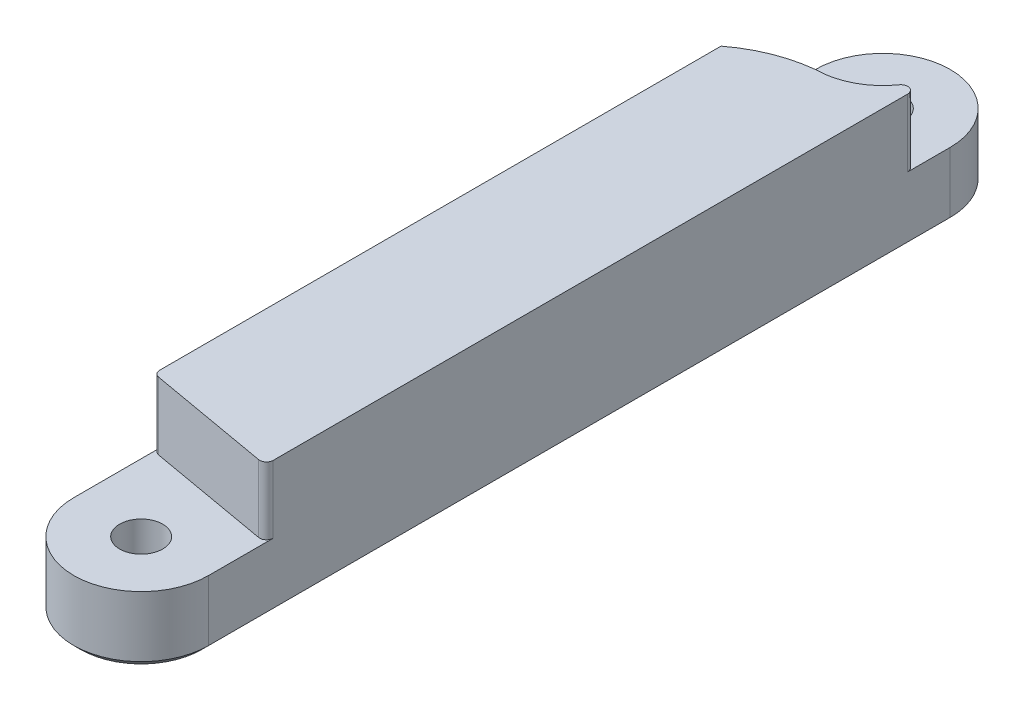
ISO-10303-21;
HEADER;
FILE_DESCRIPTION(('STEP AP214'),'2;1');
FILE_NAME('part.step','',(''),(''),'','','');
FILE_SCHEMA(('AUTOMOTIVE_DESIGN { 1 0 10303 214 1 1 1 1 }'));
ENDSEC;
DATA;
#1=APPLICATION_CONTEXT('core data for automotive mechanical design processes');
#2=APPLICATION_PROTOCOL_DEFINITION('international standard','automotive_design',2000,#1);
#3=PRODUCT_CONTEXT('',#1,'mechanical');
#4=PRODUCT('Part','Part','',(#3));
#5=PRODUCT_RELATED_PRODUCT_CATEGORY('part','',(#4));
#6=PRODUCT_DEFINITION_FORMATION('','',#4);
#7=PRODUCT_DEFINITION_CONTEXT('part definition',#1,'design');
#8=PRODUCT_DEFINITION('design','',#6,#7);
#9=PRODUCT_DEFINITION_SHAPE('','',#8);
#10=(LENGTH_UNIT() NAMED_UNIT(*) SI_UNIT(.MILLI.,.METRE.));
#11=(NAMED_UNIT(*) PLANE_ANGLE_UNIT() SI_UNIT($,.RADIAN.));
#12=(NAMED_UNIT(*) SI_UNIT($,.STERADIAN.) SOLID_ANGLE_UNIT());
#13=UNCERTAINTY_MEASURE_WITH_UNIT(LENGTH_MEASURE(1.E-05),#10,'distance_accuracy_value','');
#14=(GEOMETRIC_REPRESENTATION_CONTEXT(3) GLOBAL_UNCERTAINTY_ASSIGNED_CONTEXT((#13)) GLOBAL_UNIT_ASSIGNED_CONTEXT((#10,
#11,#12)) REPRESENTATION_CONTEXT('',''));
#15=CARTESIAN_POINT('',(0.,0.,0.));
#16=DIRECTION('',(0.,0.,1.));
#17=DIRECTION('',(1.,0.,0.));
#18=AXIS2_PLACEMENT_3D('',#15,#16,#17);
#19=CARTESIAN_POINT('',(0.,5.,0.));
#20=DIRECTION('',(0.,1.,0.));
#21=DIRECTION('',(0.,0.,1.));
#22=AXIS2_PLACEMENT_3D('',#19,#20,#21);
#23=PLANE('',#22);
#24=CARTESIAN_POINT('',(0.,5.,-55.));
#25=DIRECTION('',(0.,1.,0.));
#26=DIRECTION('',(0.,0.,1.));
#27=AXIS2_PLACEMENT_3D('',#24,#25,#26);
#28=CIRCLE('',#27,1.6);
#29=CARTESIAN_POINT('',(0.,5.,-53.4));
#30=VERTEX_POINT('',#29);
#31=EDGE_CURVE('E178',#30,#30,#28,.T.);
#32=ORIENTED_EDGE('',*,*,#31,.F.);
#33=EDGE_LOOP('',(#32));
#34=FACE_BOUND('',#33,.T.);
#35=CARTESIAN_POINT('',(1.07674481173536,5.,-40.0581379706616));
#36=DIRECTION('',(0.,1.,0.));
#37=DIRECTION('',(0.,0.,1.));
#38=AXIS2_PLACEMENT_3D('',#35,#36,#37);
#39=CIRCLE('',#38,9.99999999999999);
#40=CARTESIAN_POINT('',(0.,5.,-50.));
#41=VERTEX_POINT('',#40);
#42=CARTESIAN_POINT('',(-5.,5.,-48.));
#43=VERTEX_POINT('',#42);
#44=EDGE_CURVE('E163',#41,#43,#39,.T.);
#45=ORIENTED_EDGE('',*,*,#44,.F.);
#46=CARTESIAN_POINT('',(0.,5.,-55.));
#47=DIRECTION('',(0.,-1.,0.));
#48=DIRECTION('',(0.,0.,-1.));
#49=AXIS2_PLACEMENT_3D('',#46,#47,#48);
#50=CIRCLE('',#49,5.00000000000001);
#51=CARTESIAN_POINT('',(4.09090909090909,5.,-52.1252021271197));
#52=VERTEX_POINT('',#51);
#53=EDGE_CURVE('E175',#52,#41,#50,.T.);
#54=ORIENTED_EDGE('',*,*,#53,.F.);
#55=CARTESIAN_POINT('',(4.5,5.,-51.8377223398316));
#56=DIRECTION('',(0.,1.,0.));
#57=DIRECTION('',(0.,0.,1.));
#58=AXIS2_PLACEMENT_3D('',#55,#56,#57);
#59=CIRCLE('',#58,0.5);
#60=CARTESIAN_POINT('',(5.,5.,-51.8377223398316));
#61=VERTEX_POINT('',#60);
#62=EDGE_CURVE('E11',#52,#61,#59,.F.);
#63=ORIENTED_EDGE('',*,*,#62,.T.);
#64=DIRECTION('',(0.,0.,1.));
#65=VECTOR('',#64,1.);
#66=CARTESIAN_POINT('',(5.,5.,0.));
#67=LINE('',#66,#65);
#68=CARTESIAN_POINT('',(5.,5.,-55.));
#69=VERTEX_POINT('',#68);
#70=EDGE_CURVE('E66',#69,#61,#67,.T.);
#71=ORIENTED_EDGE('',*,*,#70,.F.);
#72=CARTESIAN_POINT('',(0.,5.,-55.));
#73=DIRECTION('',(0.,1.,0.));
#74=DIRECTION('',(0.,0.,1.));
#75=AXIS2_PLACEMENT_3D('',#72,#73,#74);
#76=CIRCLE('',#75,5.);
#77=CARTESIAN_POINT('',(-5.,5.,-55.));
#78=VERTEX_POINT('',#77);
#79=EDGE_CURVE('E184',#69,#78,#76,.T.);
#80=ORIENTED_EDGE('',*,*,#79,.T.);
#81=DIRECTION('',(0.,0.,-1.));
#82=VECTOR('',#81,1.);
#83=CARTESIAN_POINT('',(-5.,5.,0.));
#84=LINE('',#83,#82);
#85=EDGE_CURVE('E192',#43,#78,#84,.T.);
#86=ORIENTED_EDGE('',*,*,#85,.F.);
#87=EDGE_LOOP('',(#45,#54,#63,#71,#80,#86));
#88=FACE_BOUND('',#87,.T.);
#89=ADVANCED_FACE('F51',(#34,#88),#23,.T.);
#90=CARTESIAN_POINT('',(-5.,10.,0.));
#91=DIRECTION('',(-1.,0.,0.));
#92=DIRECTION('',(0.,0.,1.));
#93=AXIS2_PLACEMENT_3D('',#90,#91,#92);
#94=PLANE('',#93);
#95=DIRECTION('',(0.,-1.,0.));
#96=VECTOR('',#95,1.);
#97=CARTESIAN_POINT('',(-5.,5.,-55.));
#98=LINE('',#97,#96);
#99=CARTESIAN_POINT('',(-5.,0.5,-55.));
#100=VERTEX_POINT('',#99);
#101=EDGE_CURVE('E195',#78,#100,#98,.T.);
#102=ORIENTED_EDGE('',*,*,#101,.T.);
#103=DIRECTION('',(0.,0.,1.));
#104=VECTOR('',#103,1.);
#105=CARTESIAN_POINT('',(-5.,0.5,0.));
#106=LINE('',#105,#104);
#107=CARTESIAN_POINT('',(-5.,0.5,0.));
#108=VERTEX_POINT('',#107);
#109=EDGE_CURVE('E303',#100,#108,#106,.T.);
#110=ORIENTED_EDGE('',*,*,#109,.T.);
#111=DIRECTION('',(0.,-1.,0.));
#112=VECTOR('',#111,1.);
#113=CARTESIAN_POINT('',(-5.,5.,0.));
#114=LINE('',#113,#112);
#115=CARTESIAN_POINT('',(-5.,5.,0.));
#116=VERTEX_POINT('',#115);
#117=EDGE_CURVE('E224',#116,#108,#114,.T.);
#118=ORIENTED_EDGE('',*,*,#117,.F.);
#119=DIRECTION('',(0.,0.,-1.));
#120=VECTOR('',#119,1.);
#121=CARTESIAN_POINT('',(-5.,5.,0.));
#122=LINE('',#121,#120);
#123=CARTESIAN_POINT('',(-5.,5.,-6.37831777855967));
#124=VERTEX_POINT('',#123);
#125=EDGE_CURVE('E207',#116,#124,#122,.T.);
#126=ORIENTED_EDGE('',*,*,#125,.T.);
#127=DIRECTION('',(0.,-1.,0.));
#128=VECTOR('',#127,1.);
#129=CARTESIAN_POINT('',(-5.,10.,-6.37831777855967));
#130=LINE('',#129,#128);
#131=CARTESIAN_POINT('',(-5.,10.,-6.37831777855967));
#132=VERTEX_POINT('',#131);
#133=EDGE_CURVE('E254',#124,#132,#130,.F.);
#134=ORIENTED_EDGE('',*,*,#133,.T.);
#135=DIRECTION('',(0.,0.,-1.));
#136=VECTOR('',#135,1.);
#137=CARTESIAN_POINT('',(-5.,10.,0.));
#138=LINE('',#137,#136);
#139=CARTESIAN_POINT('',(-5.,10.,-48.));
#140=VERTEX_POINT('',#139);
#141=EDGE_CURVE('E228',#132,#140,#138,.T.);
#142=ORIENTED_EDGE('',*,*,#141,.T.);
#143=DIRECTION('',(0.,-1.,0.));
#144=VECTOR('',#143,1.);
#145=CARTESIAN_POINT('',(-5.,10.,-48.));
#146=LINE('',#145,#144);
#147=EDGE_CURVE('E171',#140,#43,#146,.T.);
#148=ORIENTED_EDGE('',*,*,#147,.T.);
#149=ORIENTED_EDGE('',*,*,#85,.T.);
#150=EDGE_LOOP('',(#102,#110,#118,#126,#134,#142,#148,#149));
#151=FACE_BOUND('',#150,.T.);
#152=ADVANCED_FACE('F332',(#151),#94,.T.);
#153=CARTESIAN_POINT('',(0.868240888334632,10.,-4.92403876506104));
#154=DIRECTION('',(-0.173648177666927,0.,0.984807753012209));
#155=DIRECTION('',(0.984807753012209,0.,0.173648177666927));
#156=AXIS2_PLACEMENT_3D('',#153,#154,#155);
#157=PLANE('',#156);
#158=DIRECTION('',(-0.984807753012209,0.,-0.173648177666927));
#159=VECTOR('',#158,1.);
#160=CARTESIAN_POINT('',(0.868240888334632,5.,-4.92403876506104));
#161=LINE('',#160,#159);
#162=CARTESIAN_POINT('',(4.41317591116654,5.,-4.29897107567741));
#163=VERTEX_POINT('',#162);
#164=CARTESIAN_POINT('',(-4.58682408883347,5.,-5.88591390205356));
#165=VERTEX_POINT('',#164);
#166=EDGE_CURVE('E217',#163,#165,#161,.T.);
#167=ORIENTED_EDGE('',*,*,#166,.F.);
#168=DIRECTION('',(0.,-1.,0.));
#169=VECTOR('',#168,1.);
#170=CARTESIAN_POINT('',(4.41317591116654,10.,-4.29897107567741));
#171=LINE('',#170,#169);
#172=CARTESIAN_POINT('',(4.41317591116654,10.,-4.29897107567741));
#173=VERTEX_POINT('',#172);
#174=EDGE_CURVE('E246',#163,#173,#171,.F.);
#175=ORIENTED_EDGE('',*,*,#174,.T.);
#176=DIRECTION('',(-0.984807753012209,0.,-0.173648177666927));
#177=VECTOR('',#176,1.);
#178=CARTESIAN_POINT('',(0.868240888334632,10.,-4.92403876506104));
#179=LINE('',#178,#177);
#180=CARTESIAN_POINT('',(-4.58682408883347,10.,-5.88591390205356));
#181=VERTEX_POINT('',#180);
#182=EDGE_CURVE('E231',#173,#181,#179,.T.);
#183=ORIENTED_EDGE('',*,*,#182,.T.);
#184=DIRECTION('',(0.,-1.,0.));
#185=VECTOR('',#184,1.);
#186=CARTESIAN_POINT('',(-4.58682408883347,10.,-5.88591390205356));
#187=LINE('',#186,#185);
#188=EDGE_CURVE('E242',#181,#165,#187,.T.);
#189=ORIENTED_EDGE('',*,*,#188,.T.);
#190=EDGE_LOOP('',(#167,#175,#183,#189));
#191=FACE_BOUND('',#190,.T.);
#192=ADVANCED_FACE('F341',(#191),#157,.T.);
#193=CARTESIAN_POINT('',(5.,10.,0.));
#194=DIRECTION('',(-1.,0.,0.));
#195=DIRECTION('',(0.,0.,1.));
#196=AXIS2_PLACEMENT_3D('',#193,#194,#195);
#197=PLANE('',#196);
#198=DIRECTION('',(0.,-1.,0.));
#199=VECTOR('',#198,1.);
#200=CARTESIAN_POINT('',(5.,5.,-55.));
#201=LINE('',#200,#199);
#202=CARTESIAN_POINT('',(5.,0.5,-55.));
#203=VERTEX_POINT('',#202);
#204=EDGE_CURVE('E199',#69,#203,#201,.T.);
#205=ORIENTED_EDGE('',*,*,#204,.F.);
#206=ORIENTED_EDGE('',*,*,#70,.T.);
#207=DIRECTION('',(0.,-1.,0.));
#208=VECTOR('',#207,1.);
#209=CARTESIAN_POINT('',(5.,10.,-51.8377223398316));
#210=LINE('',#209,#208);
#211=CARTESIAN_POINT('',(5.,10.,-51.8377223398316));
#212=VERTEX_POINT('',#211);
#213=EDGE_CURVE('E323',#61,#212,#210,.F.);
#214=ORIENTED_EDGE('',*,*,#213,.T.);
#215=DIRECTION('',(0.,0.,-1.));
#216=VECTOR('',#215,1.);
#217=CARTESIAN_POINT('',(5.,10.,0.));
#218=LINE('',#217,#216);
#219=CARTESIAN_POINT('',(5.,10.,-4.79137495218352));
#220=VERTEX_POINT('',#219);
#221=EDGE_CURVE('E235',#220,#212,#218,.T.);
#222=ORIENTED_EDGE('',*,*,#221,.F.);
#223=DIRECTION('',(0.,-1.,0.));
#224=VECTOR('',#223,1.);
#225=CARTESIAN_POINT('',(5.,5.,-4.79137495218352));
#226=LINE('',#225,#224);
#227=CARTESIAN_POINT('',(5.,5.,-4.79137495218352));
#228=VERTEX_POINT('',#227);
#229=EDGE_CURVE('E238',#220,#228,#226,.T.);
#230=ORIENTED_EDGE('',*,*,#229,.T.);
#231=DIRECTION('',(0.,0.,-1.));
#232=VECTOR('',#231,1.);
#233=CARTESIAN_POINT('',(5.,5.,0.));
#234=LINE('',#233,#232);
#235=CARTESIAN_POINT('',(5.,5.,0.));
#236=VERTEX_POINT('',#235);
#237=EDGE_CURVE('E214',#236,#228,#234,.T.);
#238=ORIENTED_EDGE('',*,*,#237,.F.);
#239=DIRECTION('',(0.,-1.,0.));
#240=VECTOR('',#239,1.);
#241=CARTESIAN_POINT('',(5.,5.,0.));
#242=LINE('',#241,#240);
#243=CARTESIAN_POINT('',(5.,0.5,0.));
#244=VERTEX_POINT('',#243);
#245=EDGE_CURVE('E220',#236,#244,#242,.T.);
#246=ORIENTED_EDGE('',*,*,#245,.T.);
#247=DIRECTION('',(0.,0.,-1.));
#248=VECTOR('',#247,1.);
#249=CARTESIAN_POINT('',(5.,0.5,0.));
#250=LINE('',#249,#248);
#251=EDGE_CURVE('E297',#244,#203,#250,.T.);
#252=ORIENTED_EDGE('',*,*,#251,.T.);
#253=EDGE_LOOP('',(#205,#206,#214,#222,#230,#238,#246,#252));
#254=FACE_BOUND('',#253,.T.);
#255=ADVANCED_FACE('F353',(#254),#197,.F.);
#256=CARTESIAN_POINT('',(0.,10.,0.));
#257=DIRECTION('',(0.,1.,0.));
#258=DIRECTION('',(0.,0.,1.));
#259=AXIS2_PLACEMENT_3D('',#256,#257,#258);
#260=PLANE('',#259);
#261=ORIENTED_EDGE('',*,*,#221,.T.);
#262=CARTESIAN_POINT('',(4.5,10.,-51.8377223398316));
#263=DIRECTION('',(0.,1.,0.));
#264=DIRECTION('',(0.,0.,1.));
#265=AXIS2_PLACEMENT_3D('',#262,#263,#264);
#266=CIRCLE('',#265,0.5);
#267=CARTESIAN_POINT('',(4.09090909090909,10.,-52.1252021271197));
#268=VERTEX_POINT('',#267);
#269=EDGE_CURVE('E60',#212,#268,#266,.T.);
#270=ORIENTED_EDGE('',*,*,#269,.T.);
#271=CARTESIAN_POINT('',(0.,10.,-55.));
#272=DIRECTION('',(0.,-1.,0.));
#273=DIRECTION('',(0.,0.,-1.));
#274=AXIS2_PLACEMENT_3D('',#271,#272,#273);
#275=CIRCLE('',#274,5.00000000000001);
#276=CARTESIAN_POINT('',(0.,10.,-50.));
#277=VERTEX_POINT('',#276);
#278=EDGE_CURVE('E150',#268,#277,#275,.T.);
#279=ORIENTED_EDGE('',*,*,#278,.T.);
#280=CARTESIAN_POINT('',(1.07674481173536,10.,-40.0581379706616));
#281=DIRECTION('',(0.,1.,0.));
#282=DIRECTION('',(0.,0.,1.));
#283=AXIS2_PLACEMENT_3D('',#280,#281,#282);
#284=CIRCLE('',#283,9.99999999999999);
#285=EDGE_CURVE('E155',#277,#140,#284,.T.);
#286=ORIENTED_EDGE('',*,*,#285,.T.);
#287=ORIENTED_EDGE('',*,*,#141,.F.);
#288=CARTESIAN_POINT('',(-4.5,10.,-6.37831777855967));
#289=DIRECTION('',(0.,1.,0.));
#290=DIRECTION('',(0.,0.,1.));
#291=AXIS2_PLACEMENT_3D('',#288,#289,#290);
#292=CIRCLE('',#291,0.5);
#293=EDGE_CURVE('E249',#132,#181,#292,.T.);
#294=ORIENTED_EDGE('',*,*,#293,.T.);
#295=ORIENTED_EDGE('',*,*,#182,.F.);
#296=CARTESIAN_POINT('',(4.5,10.,-4.79137495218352));
#297=DIRECTION('',(0.,1.,0.));
#298=DIRECTION('',(0.,0.,1.));
#299=AXIS2_PLACEMENT_3D('',#296,#297,#298);
#300=CIRCLE('',#299,0.5);
#301=EDGE_CURVE('E252',#173,#220,#300,.T.);
#302=ORIENTED_EDGE('',*,*,#301,.T.);
#303=EDGE_LOOP('',(#261,#270,#279,#286,#287,#294,#295,#302));
#304=FACE_BOUND('',#303,.T.);
#305=ADVANCED_FACE('F153',(#304),#260,.T.);
#306=CARTESIAN_POINT('',(0.,0.,0.));
#307=DIRECTION('',(0.,1.,0.));
#308=DIRECTION('',(0.,0.,1.));
#309=AXIS2_PLACEMENT_3D('',#306,#307,#308);
#310=PLANE('',#309);
#311=CARTESIAN_POINT('',(0.,0.,-55.));
#312=DIRECTION('',(0.,1.,0.));
#313=DIRECTION('',(0.,0.,1.));
#314=AXIS2_PLACEMENT_3D('',#311,#312,#313);
#315=CIRCLE('',#314,2.10000000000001);
#316=CARTESIAN_POINT('',(0.,0.,-52.9));
#317=VERTEX_POINT('',#316);
#318=EDGE_CURVE('E281',#317,#317,#315,.T.);
#319=ORIENTED_EDGE('',*,*,#318,.T.);
#320=EDGE_LOOP('',(#319));
#321=FACE_BOUND('',#320,.T.);
#322=CARTESIAN_POINT('',(0.,0.,0.));
#323=DIRECTION('',(0.,1.,0.));
#324=DIRECTION('',(0.,0.,1.));
#325=AXIS2_PLACEMENT_3D('',#322,#323,#324);
#326=CIRCLE('',#325,2.1);
#327=CARTESIAN_POINT('',(0.,0.,2.1));
#328=VERTEX_POINT('',#327);
#329=EDGE_CURVE('E277',#328,#328,#326,.T.);
#330=ORIENTED_EDGE('',*,*,#329,.T.);
#331=EDGE_LOOP('',(#330));
#332=FACE_BOUND('',#331,.T.);
#333=DIRECTION('',(0.,0.,1.));
#334=VECTOR('',#333,1.);
#335=CARTESIAN_POINT('',(4.50000000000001,0.,0.));
#336=LINE('',#335,#334);
#337=CARTESIAN_POINT('',(4.50000000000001,0.,-55.));
#338=VERTEX_POINT('',#337);
#339=CARTESIAN_POINT('',(4.50000000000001,0.,0.));
#340=VERTEX_POINT('',#339);
#341=EDGE_CURVE('E270',#338,#340,#336,.T.);
#342=ORIENTED_EDGE('',*,*,#341,.T.);
#343=CARTESIAN_POINT('',(0.,0.,0.));
#344=DIRECTION('',(0.,1.,0.));
#345=DIRECTION('',(0.,0.,1.));
#346=AXIS2_PLACEMENT_3D('',#343,#344,#345);
#347=CIRCLE('',#346,4.50000000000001);
#348=CARTESIAN_POINT('',(-4.50000000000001,0.,0.));
#349=VERTEX_POINT('',#348);
#350=EDGE_CURVE('E273',#340,#349,#347,.F.);
#351=ORIENTED_EDGE('',*,*,#350,.T.);
#352=DIRECTION('',(0.,0.,-1.));
#353=VECTOR('',#352,1.);
#354=CARTESIAN_POINT('',(-4.50000000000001,0.,-55.));
#355=LINE('',#354,#353);
#356=CARTESIAN_POINT('',(-4.50000000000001,0.,-55.));
#357=VERTEX_POINT('',#356);
#358=EDGE_CURVE('E264',#349,#357,#355,.T.);
#359=ORIENTED_EDGE('',*,*,#358,.T.);
#360=CARTESIAN_POINT('',(0.,0.,-55.));
#361=DIRECTION('',(0.,1.,0.));
#362=DIRECTION('',(0.,0.,1.));
#363=AXIS2_PLACEMENT_3D('',#360,#361,#362);
#364=CIRCLE('',#363,4.50000000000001);
#365=EDGE_CURVE('E267',#357,#338,#364,.F.);
#366=ORIENTED_EDGE('',*,*,#365,.T.);
#367=EDGE_LOOP('',(#342,#351,#359,#366));
#368=FACE_BOUND('',#367,.T.);
#369=ADVANCED_FACE('F381',(#321,#332,#368),#310,.F.);
#370=CARTESIAN_POINT('',(0.,5.,0.));
#371=DIRECTION('',(0.,-1.,0.));
#372=DIRECTION('',(0.,0.,-1.));
#373=AXIS2_PLACEMENT_3D('',#370,#371,#372);
#374=CYLINDRICAL_SURFACE('',#373,5.);
#375=ORIENTED_EDGE('',*,*,#117,.T.);
#376=CARTESIAN_POINT('',(0.,0.5,0.));
#377=DIRECTION('',(0.,1.,0.));
#378=DIRECTION('',(0.,0.,1.));
#379=AXIS2_PLACEMENT_3D('',#376,#377,#378);
#380=CIRCLE('',#379,5.);
#381=EDGE_CURVE('E293',#108,#244,#380,.T.);
#382=ORIENTED_EDGE('',*,*,#381,.T.);
#383=ORIENTED_EDGE('',*,*,#245,.F.);
#384=CARTESIAN_POINT('',(0.,5.,0.));
#385=DIRECTION('',(0.,1.,0.));
#386=DIRECTION('',(0.,0.,1.));
#387=AXIS2_PLACEMENT_3D('',#384,#385,#386);
#388=CIRCLE('',#387,5.);
#389=EDGE_CURVE('E210',#116,#236,#388,.T.);
#390=ORIENTED_EDGE('',*,*,#389,.F.);
#391=EDGE_LOOP('',(#375,#382,#383,#390));
#392=FACE_BOUND('',#391,.T.);
#393=ADVANCED_FACE('F378',(#392),#374,.T.);
#394=CARTESIAN_POINT('',(0.,5.,0.));
#395=DIRECTION('',(0.,-1.,0.));
#396=DIRECTION('',(0.,0.,-1.));
#397=AXIS2_PLACEMENT_3D('',#394,#395,#396);
#398=CYLINDRICAL_SURFACE('',#397,1.6);
#399=CARTESIAN_POINT('',(0.,0.500000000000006,0.));
#400=DIRECTION('',(0.,1.,0.));
#401=DIRECTION('',(0.,0.,1.));
#402=AXIS2_PLACEMENT_3D('',#399,#400,#401);
#403=CIRCLE('',#402,1.6);
#404=CARTESIAN_POINT('',(0.,0.500000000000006,1.6));
#405=VERTEX_POINT('',#404);
#406=EDGE_CURVE('E289',#405,#405,#403,.F.);
#407=ORIENTED_EDGE('',*,*,#406,.T.);
#408=EDGE_LOOP('',(#407));
#409=FACE_BOUND('',#408,.T.);
#410=CARTESIAN_POINT('',(0.,5.,0.));
#411=DIRECTION('',(0.,1.,0.));
#412=DIRECTION('',(0.,0.,1.));
#413=AXIS2_PLACEMENT_3D('',#410,#411,#412);
#414=CIRCLE('',#413,1.6);
#415=CARTESIAN_POINT('',(0.,5.,1.6));
#416=VERTEX_POINT('',#415);
#417=EDGE_CURVE('E203',#416,#416,#414,.T.);
#418=ORIENTED_EDGE('',*,*,#417,.T.);
#419=EDGE_LOOP('',(#418));
#420=FACE_BOUND('',#419,.T.);
#421=ADVANCED_FACE('F376',(#409,#420),#398,.F.);
#422=CARTESIAN_POINT('',(0.,5.,0.));
#423=DIRECTION('',(0.,1.,0.));
#424=DIRECTION('',(0.,0.,1.));
#425=AXIS2_PLACEMENT_3D('',#422,#423,#424);
#426=PLANE('',#425);
#427=ORIENTED_EDGE('',*,*,#417,.F.);
#428=EDGE_LOOP('',(#427));
#429=FACE_BOUND('',#428,.T.);
#430=ORIENTED_EDGE('',*,*,#125,.F.);
#431=ORIENTED_EDGE('',*,*,#389,.T.);
#432=ORIENTED_EDGE('',*,*,#237,.T.);
#433=CARTESIAN_POINT('',(4.5,5.,-4.79137495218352));
#434=DIRECTION('',(0.,1.,0.));
#435=DIRECTION('',(0.,0.,1.));
#436=AXIS2_PLACEMENT_3D('',#433,#434,#435);
#437=CIRCLE('',#436,0.5);
#438=EDGE_CURVE('E257',#228,#163,#437,.F.);
#439=ORIENTED_EDGE('',*,*,#438,.T.);
#440=ORIENTED_EDGE('',*,*,#166,.T.);
#441=CARTESIAN_POINT('',(-4.5,5.,-6.37831777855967));
#442=DIRECTION('',(0.,1.,0.));
#443=DIRECTION('',(0.,0.,1.));
#444=AXIS2_PLACEMENT_3D('',#441,#442,#443);
#445=CIRCLE('',#444,0.5);
#446=EDGE_CURVE('E260',#165,#124,#445,.F.);
#447=ORIENTED_EDGE('',*,*,#446,.T.);
#448=EDGE_LOOP('',(#430,#431,#432,#439,#440,#447));
#449=FACE_BOUND('',#448,.T.);
#450=ADVANCED_FACE('F345',(#429,#449),#426,.T.);
#451=CARTESIAN_POINT('',(0.,5.,-55.));
#452=DIRECTION('',(0.,-1.,0.));
#453=DIRECTION('',(0.,0.,-1.));
#454=AXIS2_PLACEMENT_3D('',#451,#452,#453);
#455=CYLINDRICAL_SURFACE('',#454,5.);
#456=ORIENTED_EDGE('',*,*,#204,.T.);
#457=CARTESIAN_POINT('',(0.,0.5,-55.));
#458=DIRECTION('',(0.,1.,0.));
#459=DIRECTION('',(0.,0.,1.));
#460=AXIS2_PLACEMENT_3D('',#457,#458,#459);
#461=CIRCLE('',#460,5.);
#462=EDGE_CURVE('E300',#203,#100,#461,.T.);
#463=ORIENTED_EDGE('',*,*,#462,.T.);
#464=ORIENTED_EDGE('',*,*,#101,.F.);
#465=ORIENTED_EDGE('',*,*,#79,.F.);
#466=EDGE_LOOP('',(#456,#463,#464,#465));
#467=FACE_BOUND('',#466,.T.);
#468=ADVANCED_FACE('F366',(#467),#455,.T.);
#469=CARTESIAN_POINT('',(0.,5.,-55.));
#470=DIRECTION('',(0.,-1.,0.));
#471=DIRECTION('',(0.,0.,-1.));
#472=AXIS2_PLACEMENT_3D('',#469,#470,#471);
#473=CYLINDRICAL_SURFACE('',#472,1.6);
#474=CARTESIAN_POINT('',(0.,0.500000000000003,-55.));
#475=DIRECTION('',(0.,1.,0.));
#476=DIRECTION('',(0.,0.,1.));
#477=AXIS2_PLACEMENT_3D('',#474,#475,#476);
#478=CIRCLE('',#477,1.6);
#479=CARTESIAN_POINT('',(0.,0.500000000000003,-53.4));
#480=VERTEX_POINT('',#479);
#481=EDGE_CURVE('E285',#480,#480,#478,.F.);
#482=ORIENTED_EDGE('',*,*,#481,.T.);
#483=EDGE_LOOP('',(#482));
#484=FACE_BOUND('',#483,.T.);
#485=ORIENTED_EDGE('',*,*,#31,.T.);
#486=EDGE_LOOP('',(#485));
#487=FACE_BOUND('',#486,.T.);
#488=ADVANCED_FACE('F369',(#484,#487),#473,.F.);
#489=CARTESIAN_POINT('',(0.,10.,-55.));
#490=DIRECTION('',(0.,-1.,0.));
#491=DIRECTION('',(0.,0.,-1.));
#492=AXIS2_PLACEMENT_3D('',#489,#490,#491);
#493=CYLINDRICAL_SURFACE('',#492,5.00000000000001);
#494=ORIENTED_EDGE('',*,*,#278,.F.);
#495=DIRECTION('',(0.,-1.,0.));
#496=VECTOR('',#495,1.);
#497=CARTESIAN_POINT('',(4.09090909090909,10.,-52.1252021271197));
#498=LINE('',#497,#496);
#499=EDGE_CURVE('E306',#268,#52,#498,.T.);
#500=ORIENTED_EDGE('',*,*,#499,.T.);
#501=ORIENTED_EDGE('',*,*,#53,.T.);
#502=DIRECTION('',(0.,-1.,0.));
#503=VECTOR('',#502,1.);
#504=CARTESIAN_POINT('',(0.,10.,-50.));
#505=LINE('',#504,#503);
#506=EDGE_CURVE('E169',#277,#41,#505,.T.);
#507=ORIENTED_EDGE('',*,*,#506,.F.);
#508=EDGE_LOOP('',(#494,#500,#501,#507));
#509=FACE_BOUND('',#508,.T.);
#510=ADVANCED_FACE('F174',(#509),#493,.F.);
#511=CARTESIAN_POINT('',(1.07674481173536,10.,-40.0581379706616));
#512=DIRECTION('',(0.,-1.,0.));
#513=DIRECTION('',(0.,0.,-1.));
#514=AXIS2_PLACEMENT_3D('',#511,#512,#513);
#515=CYLINDRICAL_SURFACE('',#514,9.99999999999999);
#516=ORIENTED_EDGE('',*,*,#44,.T.);
#517=ORIENTED_EDGE('',*,*,#147,.F.);
#518=ORIENTED_EDGE('',*,*,#285,.F.);
#519=ORIENTED_EDGE('',*,*,#506,.T.);
#520=EDGE_LOOP('',(#516,#517,#518,#519));
#521=FACE_BOUND('',#520,.T.);
#522=ADVANCED_FACE('F168',(#521),#515,.T.);
#523=CARTESIAN_POINT('',(4.5,10.,-4.79137495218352));
#524=DIRECTION('',(0.,1.,0.));
#525=DIRECTION('',(0.,0.,1.));
#526=AXIS2_PLACEMENT_3D('',#523,#524,#525);
#527=CYLINDRICAL_SURFACE('',#526,0.5);
#528=ORIENTED_EDGE('',*,*,#301,.F.);
#529=ORIENTED_EDGE('',*,*,#174,.F.);
#530=ORIENTED_EDGE('',*,*,#438,.F.);
#531=ORIENTED_EDGE('',*,*,#229,.F.);
#532=EDGE_LOOP('',(#528,#529,#530,#531));
#533=FACE_BOUND('',#532,.T.);
#534=ADVANCED_FACE('F350',(#533),#527,.T.);
#535=CARTESIAN_POINT('',(-4.5,10.,-6.37831777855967));
#536=DIRECTION('',(0.,-1.,0.));
#537=DIRECTION('',(0.,0.,-1.));
#538=AXIS2_PLACEMENT_3D('',#535,#536,#537);
#539=CYLINDRICAL_SURFACE('',#538,0.5);
#540=ORIENTED_EDGE('',*,*,#293,.F.);
#541=ORIENTED_EDGE('',*,*,#133,.F.);
#542=ORIENTED_EDGE('',*,*,#446,.F.);
#543=ORIENTED_EDGE('',*,*,#188,.F.);
#544=EDGE_LOOP('',(#540,#541,#542,#543));
#545=FACE_BOUND('',#544,.T.);
#546=ADVANCED_FACE('F338',(#545),#539,.T.);
#547=CARTESIAN_POINT('',(0.,0.,-55.));
#548=DIRECTION('',(0.,-1.,0.));
#549=DIRECTION('',(0.,0.,-1.));
#550=AXIS2_PLACEMENT_3D('',#547,#548,#549);
#551=CONICAL_SURFACE('',#550,2.10000000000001,0.785398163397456);
#552=ORIENTED_EDGE('',*,*,#481,.F.);
#553=EDGE_LOOP('',(#552));
#554=FACE_BOUND('',#553,.T.);
#555=ORIENTED_EDGE('',*,*,#318,.F.);
#556=EDGE_LOOP('',(#555));
#557=FACE_BOUND('',#556,.T.);
#558=ADVANCED_FACE('F399',(#554,#557),#551,.F.);
#559=CARTESIAN_POINT('',(0.,0.,0.));
#560=DIRECTION('',(0.,-1.,0.));
#561=DIRECTION('',(0.,0.,-1.));
#562=AXIS2_PLACEMENT_3D('',#559,#560,#561);
#563=CONICAL_SURFACE('',#562,2.1,0.785398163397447);
#564=ORIENTED_EDGE('',*,*,#406,.F.);
#565=EDGE_LOOP('',(#564));
#566=FACE_BOUND('',#565,.T.);
#567=ORIENTED_EDGE('',*,*,#329,.F.);
#568=EDGE_LOOP('',(#567));
#569=FACE_BOUND('',#568,.T.);
#570=ADVANCED_FACE('F406',(#566,#569),#563,.F.);
#571=CARTESIAN_POINT('',(0.,0.5,-55.));
#572=DIRECTION('',(0.,1.,0.));
#573=DIRECTION('',(0.,0.,1.));
#574=AXIS2_PLACEMENT_3D('',#571,#572,#573);
#575=CONICAL_SURFACE('',#574,5.,0.785398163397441);
#576=DIRECTION('',(0.707106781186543,0.707106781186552,0.));
#577=VECTOR('',#576,1.);
#578=CARTESIAN_POINT('',(4.50000000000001,0.,-55.));
#579=LINE('',#578,#577);
#580=EDGE_CURVE('E313',#338,#203,#579,.T.);
#581=ORIENTED_EDGE('',*,*,#580,.F.);
#582=ORIENTED_EDGE('',*,*,#365,.F.);
#583=DIRECTION('',(0.707106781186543,-0.707106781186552,0.));
#584=VECTOR('',#583,1.);
#585=CARTESIAN_POINT('',(-5.,0.5,-55.));
#586=LINE('',#585,#584);
#587=EDGE_CURVE('E317',#100,#357,#586,.T.);
#588=ORIENTED_EDGE('',*,*,#587,.F.);
#589=ORIENTED_EDGE('',*,*,#462,.F.);
#590=EDGE_LOOP('',(#581,#582,#588,#589));
#591=FACE_BOUND('',#590,.T.);
#592=ADVANCED_FACE('F413',(#591),#575,.T.);
#593=CARTESIAN_POINT('',(-4.50000000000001,0.,0.));
#594=DIRECTION('',(-0.707106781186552,-0.707106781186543,0.));
#595=DIRECTION('',(0.,0.,1.));
#596=AXIS2_PLACEMENT_3D('',#593,#594,#595);
#597=PLANE('',#596);
#598=ORIENTED_EDGE('',*,*,#587,.T.);
#599=ORIENTED_EDGE('',*,*,#358,.F.);
#600=DIRECTION('',(0.707106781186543,-0.707106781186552,0.));
#601=VECTOR('',#600,1.);
#602=CARTESIAN_POINT('',(-5.,0.5,0.));
#603=LINE('',#602,#601);
#604=EDGE_CURVE('E310',#108,#349,#603,.T.);
#605=ORIENTED_EDGE('',*,*,#604,.F.);
#606=ORIENTED_EDGE('',*,*,#109,.F.);
#607=EDGE_LOOP('',(#598,#599,#605,#606));
#608=FACE_BOUND('',#607,.T.);
#609=ADVANCED_FACE('F429',(#608),#597,.T.);
#610=CARTESIAN_POINT('',(5.,0.5,0.));
#611=DIRECTION('',(-0.707106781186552,0.707106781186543,0.));
#612=DIRECTION('',(0.,0.,-1.));
#613=AXIS2_PLACEMENT_3D('',#610,#611,#612);
#614=PLANE('',#613);
#615=ORIENTED_EDGE('',*,*,#580,.T.);
#616=ORIENTED_EDGE('',*,*,#251,.F.);
#617=DIRECTION('',(0.707106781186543,0.707106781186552,0.));
#618=VECTOR('',#617,1.);
#619=CARTESIAN_POINT('',(4.50000000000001,0.,0.));
#620=LINE('',#619,#618);
#621=EDGE_CURVE('E307',#340,#244,#620,.T.);
#622=ORIENTED_EDGE('',*,*,#621,.F.);
#623=ORIENTED_EDGE('',*,*,#341,.F.);
#624=EDGE_LOOP('',(#615,#616,#622,#623));
#625=FACE_BOUND('',#624,.T.);
#626=ADVANCED_FACE('F422',(#625),#614,.F.);
#627=CARTESIAN_POINT('',(0.,0.5,0.));
#628=DIRECTION('',(0.,1.,0.));
#629=DIRECTION('',(0.,0.,1.));
#630=AXIS2_PLACEMENT_3D('',#627,#628,#629);
#631=CONICAL_SURFACE('',#630,5.,0.785398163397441);
#632=ORIENTED_EDGE('',*,*,#604,.T.);
#633=ORIENTED_EDGE('',*,*,#350,.F.);
#634=ORIENTED_EDGE('',*,*,#621,.T.);
#635=ORIENTED_EDGE('',*,*,#381,.F.);
#636=EDGE_LOOP('',(#632,#633,#634,#635));
#637=FACE_BOUND('',#636,.T.);
#638=ADVANCED_FACE('F416',(#637),#631,.T.);
#639=CARTESIAN_POINT('',(4.5,10.,-51.8377223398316));
#640=DIRECTION('',(0.,-1.,0.));
#641=DIRECTION('',(0.,0.,-1.));
#642=AXIS2_PLACEMENT_3D('',#639,#640,#641);
#643=CYLINDRICAL_SURFACE('',#642,0.5);
#644=ORIENTED_EDGE('',*,*,#269,.F.);
#645=ORIENTED_EDGE('',*,*,#213,.F.);
#646=ORIENTED_EDGE('',*,*,#62,.F.);
#647=ORIENTED_EDGE('',*,*,#499,.F.);
#648=EDGE_LOOP('',(#644,#645,#646,#647));
#649=FACE_BOUND('',#648,.T.);
#650=ADVANCED_FACE('F53',(#649),#643,.T.);
#651=CLOSED_SHELL('',(#89,#152,#192,#255,#305,#369,#393,#421,#450,#468,#488,#510,#522,#534,#546,
#558,#570,#592,#609,#626,#638,#650));
#652=MANIFOLD_SOLID_BREP('B2',#651);
#653=ADVANCED_BREP_SHAPE_REPRESENTATION('',(#18,#652),#14);
#654=SHAPE_DEFINITION_REPRESENTATION(#9,#653);
ENDSEC;
END-ISO-10303-21;
